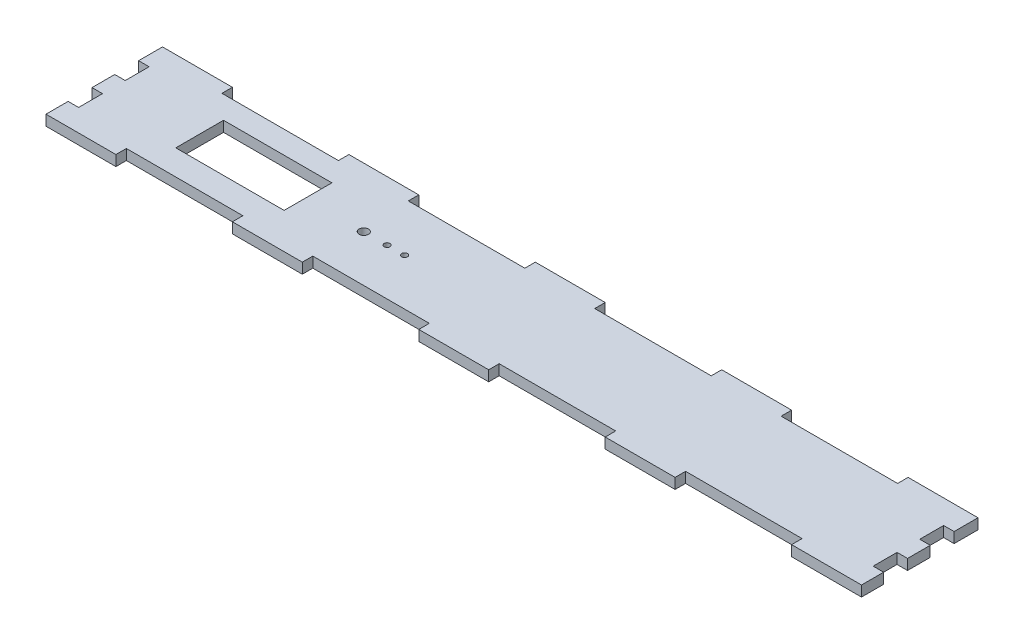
from build123d import *

# Parameters (mm, degrees)
BOSS_EXTRUDE1_DEPTH = 9
SKETCH2_W           = 100
SKETCH2_H           = 9
CUT_EXTRUDE1_DEPTH  = 9
SKETCH3_W           = 93
SKETCH3_H           = 41
CUT_EXTRUDE3_DEPTH  = 354.667923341
SKETCH4_R           = 2.5
SKETCH4_R_2         = 4
CUT_EXTRUDE4_DEPTH  = 354.667923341


with BuildPart() as part:
    # Sketch1 → Boss-Extrude1 (new body)
    with BuildSketch(Plane(origin=(0, 0, 0), x_dir=(1, 0, 0), z_dir=(0, 1, 0))):
        Polygon((-350, 50), (350, 50), (350, 29.5), (341, 29.5), (341, 9), (350, 9), (350, -10.5), (341, -10.5), (341, -31), (350, -31), (350, -50), (-350, -50), (-350, -31), (-341, -31), (-341, -10.5), (-350, -10.5), (-350, 9), (-341, 9), (-341, 29.5), (-350, 29.5), align=None)
    extrude(amount=BOSS_EXTRUDE1_DEPTH)

    # Sketch2 → Cut-Extrude1 (cut)
    with BuildSketch(Plane(origin=(0, 9, 0), x_dir=(1, 0, 0), z_dir=(0, 1, 0))):
        with Locations((-240, 45.5)):
            Rectangle(SKETCH2_W, SKETCH2_H)
        with Locations((-80, 45.5)):
            Rectangle(SKETCH2_W, SKETCH2_H)
        with Locations((80, 45.5)):
            Rectangle(SKETCH2_W, SKETCH2_H)
        with Locations((240, 45.5)):
            Rectangle(SKETCH2_W, SKETCH2_H)
        with Locations((240, -45.5)):
            Rectangle(SKETCH2_W, SKETCH2_H)
        with Locations((80, -45.5)):
            Rectangle(SKETCH2_W, SKETCH2_H)
        with Locations((-80, -45.5)):
            Rectangle(SKETCH2_W, SKETCH2_H)
        with Locations((-240, -45.5)):
            Rectangle(SKETCH2_W, SKETCH2_H)
    extrude(amount=-CUT_EXTRUDE1_DEPTH, mode=Mode.SUBTRACT)

    # Sketch3 → Cut-Extrude3 (cut, through all)
    with BuildSketch(Plane(origin=(0, 9, 0), x_dir=(1, 0, 0), z_dir=(0, 1, 0))):
        with Locations((-222.765940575, 1.160188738)):
            Rectangle(SKETCH3_W, SKETCH3_H)
    extrude(amount=-CUT_EXTRUDE3_DEPTH, mode=Mode.SUBTRACT)

    # Sketch4 → Cut-Extrude4 (cut, through all)
    with BuildSketch(Plane(origin=(0, 9, 0), x_dir=(1, 0, 0), z_dir=(0, 1, 0))):
        with Locations(Location((-106.265940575, -0.957544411, 0), (0, 0, 270))):
            Circle(SKETCH4_R)
        with Locations(Location((-91.265940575, -0.957544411, 0), (0, 0, 270))):
            Circle(SKETCH4_R)
        with Locations(Location((-126.265940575, -0.957544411, 0), (0, 0, 270))):
            Circle(SKETCH4_R_2)
    extrude(amount=-CUT_EXTRUDE4_DEPTH, mode=Mode.SUBTRACT)


solid = part.part
